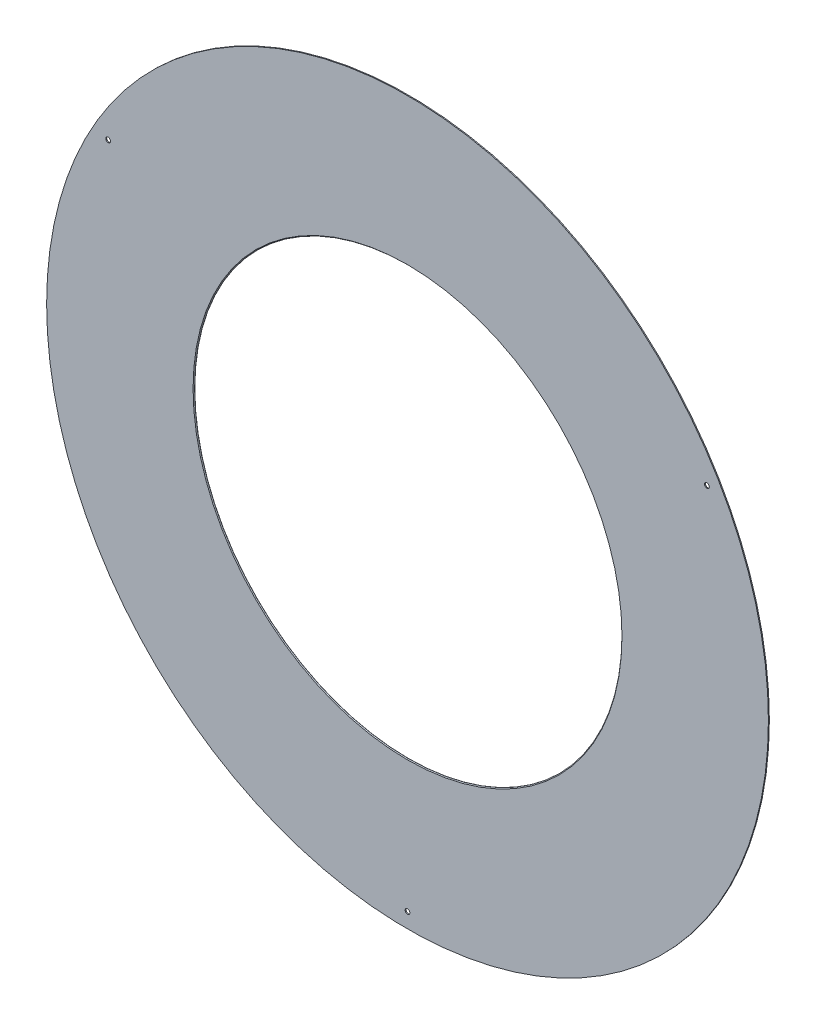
from build123d import *

# Parameters (mm, degrees)
SKETCH1_R                      = 603.25
SKETCH1_R_2                    = 357.1875
BOSS_EXTRUDE1_DEPTH            = 1.5875
CHAMFER1_SIZE                  = 1.27
F_5_16_0_3125_DIAMETER_HOLE1_D = 7.9375
CIRPATTERN1_COUNT              = 3


with BuildPart() as part:
    # Sketch1 → Boss-Extrude1 (new body)
    with BuildSketch(Plane.XY):
        Circle(SKETCH1_R)
        Circle(SKETCH1_R_2, mode=Mode.SUBTRACT)
    extrude(amount=BOSS_EXTRUDE1_DEPTH)

    # Chamfer1
    chamfer1_edges = [part.edges().sort_by_distance(p)[0] for p in [
        (-357.1875, 0, 1.5875),
    ]]
    chamfer(chamfer1_edges, length=CHAMFER1_SIZE)

    # 5_16 _0.3125_ Diameter Hole1 (through all)
    with Locations(Plane.XY.offset(1.5875)):
        with Locations((0, -577.85)):
            f_5_16_0_3125_diameter_hole1 = Hole(F_5_16_0_3125_DIAMETER_HOLE1_D / 2)

    # CirPattern1: 5_16 _0.3125_ Diameter Hole1 ×3 about axis
    cirpattern1_axis = Axis((0, 0, 0), (0, 0, 1))
    for i in range(1, CIRPATTERN1_COUNT):
        add(f_5_16_0_3125_diameter_hole1.rotate(cirpattern1_axis, i * 360 / CIRPATTERN1_COUNT), mode=Mode.SUBTRACT)


solid = part.part
